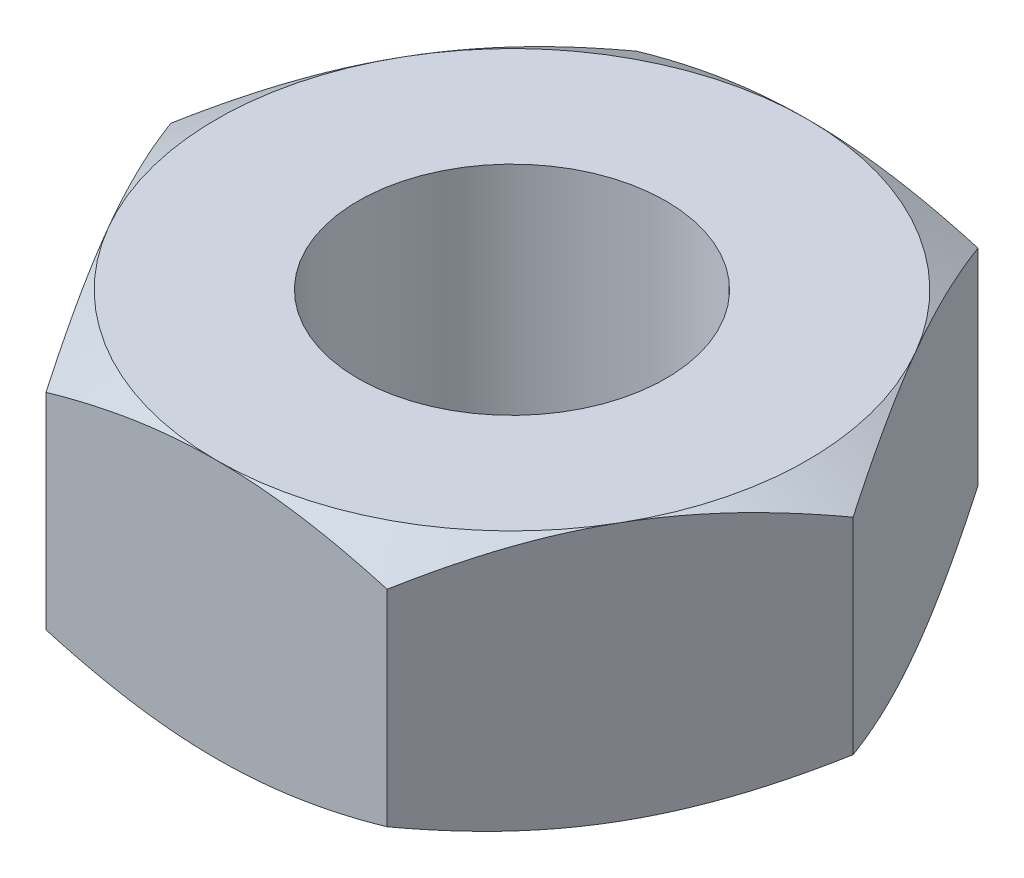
from build123d import *

# Parameters (mm, degrees)
BOSS_EXTRUDE1_DEPTH   = 4.2
SKETCH2_OUTSIDE_W     = 43.85
SKETCH2_OUTSIDE_H     = 42.364
SKETCH2_OUTSIDE_R     = 4.8
CUT_EXTRUDE1_DEPTH    = 8
CUT_EXTRUDE1_DRAFT    = -60
SKETCH3_OUTSIDE_W     = 43.85
SKETCH3_OUTSIDE_H     = 42.364
SKETCH3_OUTSIDE_R     = 4.8
CUT_EXTRUDE2_DEPTH    = 8
CUT_EXTRUDE2_DRAFT    = -60
M6X1_0_TAPPED_HOLE1_D = 5


with BuildPart() as part:
    # Sketch1 → Boss-Extrude1 (new body)
    with BuildSketch(Plane(origin=(0, 0, 0), x_dir=(1, 0, 0), z_dir=(0, 1, 0))):
        Polygon((5.542562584, 0), (2.771281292, 4.8), (-2.771281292, 4.8), (-5.542562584, 0), (-2.771281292, -4.8), (2.771281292, -4.8), align=None)
    extrude(amount=BOSS_EXTRUDE1_DEPTH)


with BuildPart() as cut_extrude1_tool:
    # Sketch2 outside → Cut-Extrude1 (with draft: the straight prism first)
    with BuildSketch(Plane(origin=(0, 4.2, 0), x_dir=(1, 0, 0), z_dir=(0, 1, 0))):
        Rectangle(SKETCH2_OUTSIDE_W, SKETCH2_OUTSIDE_H)
        Circle(SKETCH2_OUTSIDE_R, mode=Mode.SUBTRACT)
    extrude(amount=-CUT_EXTRUDE1_DEPTH)
    # Cut-Extrude1: the draft: its side faces are tilted about the plane it starts from
    cut_extrude1_sides = [cut_extrude1_tool.faces().sort_by_distance(p)[0] for p in [
        (0, 0.2, 21.182),
        (21.925, 0.2, 0),
        (0, 0.2, -21.182),
        (-21.925, 0.2, 0),
        (-4.8, 0.2, 0),
    ]]
    draft(cut_extrude1_sides, Plane(origin=(0, 4.2, 0), x_dir=(1, 0, 0), z_dir=(0, 1, 0)), CUT_EXTRUDE1_DRAFT)


with BuildPart() as part_1:
    add(part.part)

    # Cut-Extrude1: cut by cut_extrude1_tool
    add(cut_extrude1_tool.part, mode=Mode.SUBTRACT)


with BuildPart() as cut_extrude2_tool:
    # Sketch3 outside → Cut-Extrude2 (with draft: the straight prism first)
    with BuildSketch(Plane(origin=(0, 0, 0), x_dir=(-1, 0, 0), z_dir=(0, -1, 0))):
        Rectangle(SKETCH3_OUTSIDE_W, SKETCH3_OUTSIDE_H)
        Circle(SKETCH3_OUTSIDE_R, mode=Mode.SUBTRACT)
    extrude(amount=-CUT_EXTRUDE2_DEPTH)
    # Cut-Extrude2: the draft: its side faces are tilted about the plane it starts from
    cut_extrude2_sides = [cut_extrude2_tool.faces().sort_by_distance(p)[0] for p in [
        (0, 4, 21.182),
        (-21.925, 4, 0),
        (0, 4, -21.182),
        (21.925, 4, 0),
        (4.8, 4, 0),
    ]]
    draft(cut_extrude2_sides, Plane(origin=(0, 0, 0), x_dir=(-1, 0, 0), z_dir=(0, -1, 0)), CUT_EXTRUDE2_DRAFT)


with BuildPart() as part_2:
    add(part_1.part)

    # Cut-Extrude2: cut by cut_extrude2_tool
    add(cut_extrude2_tool.part, mode=Mode.SUBTRACT)

    # M6x1.0 Tapped Hole1 (through all)
    with Locations(Plane(origin=(0, 4.2, 0), x_dir=(1, 0, 0), z_dir=(0, 1, 0))):
        with Locations((0, 0)):
            Hole(M6X1_0_TAPPED_HOLE1_D / 2)


solid = part_2.part
